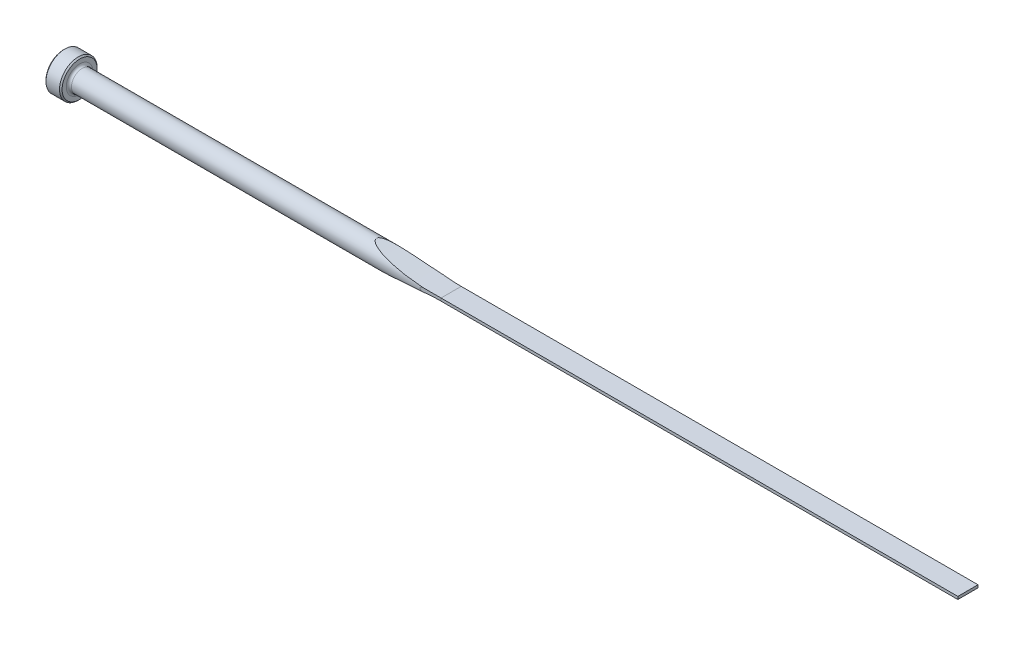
from build123d import *

# Parameters (mm, degrees)
CUT_EXTRUDE1_DEPTH = 267.815465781
CUT_EXTRUDE2_DEPTH = 267.815465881
FILLET1_R          = 0.762
CHAMFER1_SIZE      = 0.381


with BuildPart() as part:
    # Sketch1 → Revolve1 (revolve)
    with BuildSketch(Plane.XY, mode=Mode.PRIVATE) as revolve1_sk:
        Polygon((0, 0), (0, 5.5499), (4.7498, 5.5499), (4.7498, 3.175), (266.7, 3.175), (266.7, 0), align=None)
    revolve(revolve1_sk.sketch.rotate(Axis((0, 0, 0), (1, 0, 0)), 90), axis=Axis((0, 0, 0), (1, 0, 0)))

    # Sketch2 → Cut-Extrude1 (cut, symmetric)
    with BuildSketch(Plane.XY):
        with BuildLine():
            Line((266.7, 3.175), (266.7, 0.4064))
            Line((266.7, 0.4064), (114.3, 0.4064))
            ThreePointArc((114.3, 0.4064), (103.206566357, 1.101265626), (92.286551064, 3.175))
            Line((92.286551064, 3.175), (266.7, 3.175))
        make_face()
    cut_extrude1 = extrude(amount=CUT_EXTRUDE1_DEPTH, both=True, mode=Mode.SUBTRACT)

    # Mirror1: Cut-Extrude1 across plane
    add(cut_extrude1.mirror(Plane.ZX), mode=Mode.SUBTRACT)

    # Sketch3 → Cut-Extrude2 (cut, symmetric)
    with BuildSketch(Plane(origin=(0, 0, 0), x_dir=(1, 0, 0), z_dir=(0, 1, 0))):
        with BuildLine():
            Line((266.7, 3.175), (266.7, 2.9718))
            Line((266.7, 2.9718), (114.3, 2.9718))
            ThreePointArc((114.3, 2.9718), (111.29463147, 3.022614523), (108.292698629, 3.175))
            Line((108.292698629, 3.175), (266.7, 3.175))
        make_face()
    cut_extrude2 = extrude(amount=CUT_EXTRUDE2_DEPTH, both=True, mode=Mode.SUBTRACT)

    # Mirror2: Cut-Extrude2 across plane
    add(cut_extrude2.mirror(Plane.XY), mode=Mode.SUBTRACT)

    # Fillet1
    fillet1_edges = [part.edges().sort_by_distance(p)[0] for p in [
        (4.7498, 0, -3.175),
    ]]
    fillet(fillet1_edges, radius=FILLET1_R)

    # Chamfer1
    chamfer1_edges = [part.edges().sort_by_distance(p)[0] for p in [
        (4.7498, 0, -5.5499),
        (0, 0, -5.5499),
    ]]
    chamfer(chamfer1_edges, length=CHAMFER1_SIZE)


solid = part.part
